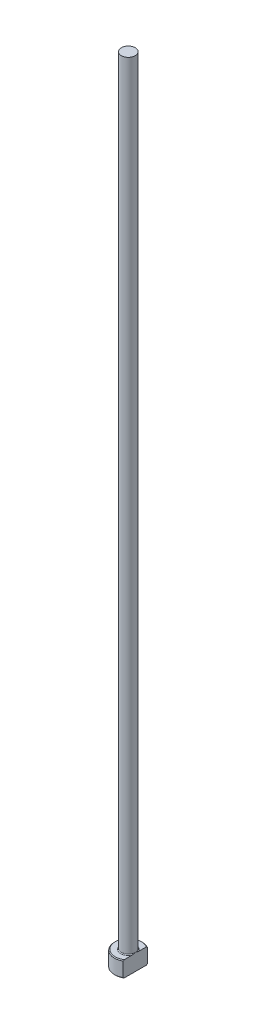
ISO-10303-21;
HEADER;
FILE_DESCRIPTION(('STEP AP214'),'2;1');
FILE_NAME('part.step','',(''),(''),'','','');
FILE_SCHEMA(('AUTOMOTIVE_DESIGN { 1 0 10303 214 1 1 1 1 }'));
ENDSEC;
DATA;
#1=APPLICATION_CONTEXT('core data for automotive mechanical design processes');
#2=APPLICATION_PROTOCOL_DEFINITION('international standard','automotive_design',2000,#1);
#3=PRODUCT_CONTEXT('',#1,'mechanical');
#4=PRODUCT('Part','Part','',(#3));
#5=PRODUCT_RELATED_PRODUCT_CATEGORY('part','',(#4));
#6=PRODUCT_DEFINITION_FORMATION('','',#4);
#7=PRODUCT_DEFINITION_CONTEXT('part definition',#1,'design');
#8=PRODUCT_DEFINITION('design','',#6,#7);
#9=PRODUCT_DEFINITION_SHAPE('','',#8);
#10=(LENGTH_UNIT() NAMED_UNIT(*) SI_UNIT(.MILLI.,.METRE.));
#11=(NAMED_UNIT(*) PLANE_ANGLE_UNIT() SI_UNIT($,.RADIAN.));
#12=(NAMED_UNIT(*) SI_UNIT($,.STERADIAN.) SOLID_ANGLE_UNIT());
#13=UNCERTAINTY_MEASURE_WITH_UNIT(LENGTH_MEASURE(1.E-05),#10,'distance_accuracy_value','');
#14=(GEOMETRIC_REPRESENTATION_CONTEXT(3) GLOBAL_UNCERTAINTY_ASSIGNED_CONTEXT((#13)) GLOBAL_UNIT_ASSIGNED_CONTEXT((#10,
#11,#12)) REPRESENTATION_CONTEXT('',''));
#15=CARTESIAN_POINT('',(0.,0.,0.));
#16=DIRECTION('',(0.,0.,1.));
#17=DIRECTION('',(1.,0.,0.));
#18=AXIS2_PLACEMENT_3D('',#15,#16,#17);
#19=CARTESIAN_POINT('',(0.,0.,0.));
#20=DIRECTION('',(0.,-1.,0.));
#21=DIRECTION('',(0.,0.,-1.));
#22=AXIS2_PLACEMENT_3D('',#19,#20,#21);
#23=PLANE('',#22);
#24=CARTESIAN_POINT('',(0.,0.,0.));
#25=DIRECTION('',(0.,-1.,0.));
#26=DIRECTION('',(0.,0.,-1.));
#27=AXIS2_PLACEMENT_3D('',#24,#25,#26);
#28=CIRCLE('',#27,3.29999999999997);
#29=CARTESIAN_POINT('',(1.74999999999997,0.,2.79776696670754));
#30=VERTEX_POINT('',#29);
#31=CARTESIAN_POINT('',(1.74999999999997,0.,-2.79776696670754));
#32=VERTEX_POINT('',#31);
#33=EDGE_CURVE('E98',#30,#32,#28,.T.);
#34=ORIENTED_EDGE('',*,*,#33,.T.);
#35=DIRECTION('',(0.,0.,1.));
#36=VECTOR('',#35,1.);
#37=CARTESIAN_POINT('',(1.74999999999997,0.,3.03108891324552));
#38=LINE('',#37,#36);
#39=EDGE_CURVE('E83',#32,#30,#38,.T.);
#40=ORIENTED_EDGE('',*,*,#39,.T.);
#41=EDGE_LOOP('',(#34,#40));
#42=FACE_BOUND('',#41,.T.);
#43=ADVANCED_FACE('F32',(#42),#23,.T.);
#44=CARTESIAN_POINT('',(0.,259.958771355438,0.));
#45=DIRECTION('',(0.,1.,0.));
#46=DIRECTION('',(0.,0.,1.));
#47=AXIS2_PLACEMENT_3D('',#44,#45,#46);
#48=CYLINDRICAL_SURFACE('',#47,3.49999999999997);
#49=CARTESIAN_POINT('',(0.,3.80000000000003,0.));
#50=DIRECTION('',(0.,1.,0.));
#51=DIRECTION('',(0.,0.,1.));
#52=AXIS2_PLACEMENT_3D('',#49,#50,#51);
#53=CIRCLE('',#52,3.49999999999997);
#54=CARTESIAN_POINT('',(1.74999999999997,3.80000000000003,3.03108891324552));
#55=VERTEX_POINT('',#54);
#56=CARTESIAN_POINT('',(1.74999999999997,3.80000000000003,-3.03108891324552));
#57=VERTEX_POINT('',#56);
#58=EDGE_CURVE('E104',#55,#57,#53,.F.);
#59=ORIENTED_EDGE('',*,*,#58,.T.);
#60=DIRECTION('',(0.,-1.,0.));
#61=VECTOR('',#60,1.);
#62=CARTESIAN_POINT('',(1.74999999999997,200.,-3.03108891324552));
#63=LINE('',#62,#61);
#64=CARTESIAN_POINT('',(1.74999999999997,0.199999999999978,-3.03108891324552));
#65=VERTEX_POINT('',#64);
#66=EDGE_CURVE('E183',#57,#65,#63,.T.);
#67=ORIENTED_EDGE('',*,*,#66,.T.);
#68=CARTESIAN_POINT('',(0.,0.199999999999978,0.));
#69=DIRECTION('',(0.,-1.,0.));
#70=DIRECTION('',(0.,0.,-1.));
#71=AXIS2_PLACEMENT_3D('',#68,#69,#70);
#72=CIRCLE('',#71,3.49999999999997);
#73=CARTESIAN_POINT('',(1.74999999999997,0.199999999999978,3.03108891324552));
#74=VERTEX_POINT('',#73);
#75=EDGE_CURVE('E100',#65,#74,#72,.F.);
#76=ORIENTED_EDGE('',*,*,#75,.T.);
#77=DIRECTION('',(0.,-1.,0.));
#78=VECTOR('',#77,1.);
#79=CARTESIAN_POINT('',(1.74999999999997,200.,3.03108891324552));
#80=LINE('',#79,#78);
#81=EDGE_CURVE('E93',#55,#74,#80,.T.);
#82=ORIENTED_EDGE('',*,*,#81,.F.);
#83=EDGE_LOOP('',(#59,#67,#76,#82));
#84=FACE_BOUND('',#83,.T.);
#85=ADVANCED_FACE('F158',(#84),#48,.T.);
#86=CARTESIAN_POINT('',(-3.49999999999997,4.,0.));
#87=DIRECTION('',(0.,1.,0.));
#88=DIRECTION('',(0.,0.,1.));
#89=AXIS2_PLACEMENT_3D('',#86,#87,#88);
#90=PLANE('',#89);
#91=CARTESIAN_POINT('',(0.,4.,0.));
#92=DIRECTION('',(0.,1.,0.));
#93=DIRECTION('',(0.,0.,1.));
#94=AXIS2_PLACEMENT_3D('',#91,#92,#93);
#95=CIRCLE('',#94,3.29999999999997);
#96=CARTESIAN_POINT('',(1.74999999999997,4.,-2.79776696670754));
#97=VERTEX_POINT('',#96);
#98=CARTESIAN_POINT('',(1.74999999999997,4.,2.79776696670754));
#99=VERTEX_POINT('',#98);
#100=EDGE_CURVE('E178',#97,#99,#95,.T.);
#101=ORIENTED_EDGE('',*,*,#100,.T.);
#102=DIRECTION('',(0.,0.,-1.));
#103=VECTOR('',#102,1.);
#104=CARTESIAN_POINT('',(1.74999999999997,4.,0.));
#105=LINE('',#104,#103);
#106=CARTESIAN_POINT('',(1.74999999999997,3.99999999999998,0.860232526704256));
#107=VERTEX_POINT('',#106);
#108=EDGE_CURVE('E57',#99,#107,#105,.T.);
#109=ORIENTED_EDGE('',*,*,#108,.T.);
#110=CARTESIAN_POINT('',(0.,4.,0.));
#111=DIRECTION('',(0.,1.,0.));
#112=DIRECTION('',(0.,0.,1.));
#113=AXIS2_PLACEMENT_3D('',#110,#111,#112);
#114=CIRCLE('',#113,1.94999999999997);
#115=CARTESIAN_POINT('',(1.74999999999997,3.99999999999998,-0.860232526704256));
#116=VERTEX_POINT('',#115);
#117=EDGE_CURVE('E107',#107,#116,#114,.F.);
#118=ORIENTED_EDGE('',*,*,#117,.T.);
#119=EDGE_CURVE('E136',#116,#97,#105,.T.);
#120=ORIENTED_EDGE('',*,*,#119,.T.);
#121=EDGE_LOOP('',(#101,#109,#118,#120));
#122=FACE_BOUND('',#121,.T.);
#123=ADVANCED_FACE('F147',(#122),#90,.T.);
#124=CARTESIAN_POINT('',(0.,4.,0.));
#125=DIRECTION('',(0.,-1.,0.));
#126=DIRECTION('',(0.,0.,-1.));
#127=AXIS2_PLACEMENT_3D('',#124,#125,#126);
#128=CONICAL_SURFACE('',#127,3.29999999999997,0.785398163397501);
#129=ORIENTED_EDGE('',*,*,#58,.F.);
#130=CARTESIAN_POINT('',(1.74999999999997,0.403691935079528,6.67057455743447));
#131=CARTESIAN_POINT('',(1.74999999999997,0.549902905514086,6.51940719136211));
#132=CARTESIAN_POINT('',(1.74999999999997,0.695956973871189,6.3680875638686));
#133=CARTESIAN_POINT('',(1.74999999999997,0.987658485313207,6.06505321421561));
#134=CARTESIAN_POINT('',(1.74999999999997,1.13330592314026,5.91333848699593));
#135=CARTESIAN_POINT('',(1.74999999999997,1.42417201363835,5.60934946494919));
#136=CARTESIAN_POINT('',(1.74999999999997,1.56939040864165,5.45707492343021));
#137=CARTESIAN_POINT('',(1.74999999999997,1.85918520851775,5.15191761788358));
#138=CARTESIAN_POINT('',(1.74999999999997,2.0037616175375,4.9990348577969));
#139=CARTESIAN_POINT('',(1.74999999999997,2.28922437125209,4.69552747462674));
#140=CARTESIAN_POINT('',(1.74999999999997,2.43012702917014,4.54491820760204));
#141=CARTESIAN_POINT('',(1.74999999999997,2.71087777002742,4.24272028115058));
#142=CARTESIAN_POINT('',(1.74999999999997,2.85072585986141,4.0911316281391));
#143=CARTESIAN_POINT('',(1.74999999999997,3.12895853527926,3.78667524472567));
#144=CARTESIAN_POINT('',(1.74999999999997,3.26734342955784,3.63380779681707));
#145=CARTESIAN_POINT('',(1.74999999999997,3.54209958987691,3.32627683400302));
#146=CARTESIAN_POINT('',(1.74999999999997,3.67847093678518,3.17161339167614));
#147=CARTESIAN_POINT('',(1.74999999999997,3.8961728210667,2.91990258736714));
#148=CARTESIAN_POINT('',(1.74999999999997,3.97843114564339,2.82365864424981));
#149=CARTESIAN_POINT('',(1.74999999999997,4.14148360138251,2.62991861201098));
#150=CARTESIAN_POINT('',(1.74999999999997,4.2222775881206,2.53242240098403));
#151=CARTESIAN_POINT('',(1.74999999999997,4.38274452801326,2.33479038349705));
#152=CARTESIAN_POINT('',(1.74999999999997,4.46239661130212,2.23463757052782));
#153=CARTESIAN_POINT('',(1.74999999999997,4.61891495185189,2.03220225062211));
#154=CARTESIAN_POINT('',(1.74999999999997,4.69578187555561,1.92992026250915));
#155=CARTESIAN_POINT('',(1.74999999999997,4.84669654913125,1.72090511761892));
#156=CARTESIAN_POINT('',(1.74999999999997,4.92068375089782,1.61412795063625));
#157=CARTESIAN_POINT('',(1.74999999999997,5.06269616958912,1.39638381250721));
#158=CARTESIAN_POINT('',(1.74999999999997,5.13071318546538,1.28541136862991));
#159=CARTESIAN_POINT('',(1.74999999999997,5.22516490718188,1.11561175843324));
#160=CARTESIAN_POINT('',(1.74999999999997,5.25522351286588,1.058816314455));
#161=CARTESIAN_POINT('',(1.74999999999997,5.31237042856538,0.943756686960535));
#162=CARTESIAN_POINT('',(1.74999999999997,5.33945819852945,0.885492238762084));
#163=CARTESIAN_POINT('',(1.74999999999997,5.41499290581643,0.708569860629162));
#164=CARTESIAN_POINT('',(1.74999999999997,5.45796078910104,0.58735672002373));
#165=CARTESIAN_POINT('',(1.74999999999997,5.50447230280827,0.405622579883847));
#166=CARTESIAN_POINT('',(1.74999999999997,5.51680920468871,0.347327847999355));
#167=CARTESIAN_POINT('',(1.74999999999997,5.53592536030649,0.229813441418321));
#168=CARTESIAN_POINT('',(1.74999999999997,5.54270510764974,0.170593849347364));
#169=CARTESIAN_POINT('',(1.74999999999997,5.55022681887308,0.0519516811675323));
#170=CARTESIAN_POINT('',(1.74999999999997,5.55098747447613,-0.00746969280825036));
#171=CARTESIAN_POINT('',(1.74999999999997,5.5464654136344,-0.12608281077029));
#172=CARTESIAN_POINT('',(1.74999999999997,5.54118219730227,-0.185274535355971));
#173=CARTESIAN_POINT('',(1.74999999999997,5.52501178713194,-0.302357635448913));
#174=CARTESIAN_POINT('',(1.74999999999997,5.51417270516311,-0.360255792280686));
#175=CARTESIAN_POINT('',(1.74999999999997,5.48756668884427,-0.474896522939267));
#176=CARTESIAN_POINT('',(1.74999999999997,5.47179916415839,-0.531638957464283));
#177=CARTESIAN_POINT('',(1.74999999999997,5.43599695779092,-0.64410319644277));
#178=CARTESIAN_POINT('',(1.74999999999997,5.41593824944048,-0.699817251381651));
#179=CARTESIAN_POINT('',(1.74999999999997,5.37235913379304,-0.809843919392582));
#180=CARTESIAN_POINT('',(1.74999999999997,5.348839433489,-0.864156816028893));
#181=CARTESIAN_POINT('',(1.74999999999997,5.27385837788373,-1.0256237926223));
#182=CARTESIAN_POINT('',(1.74999999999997,5.21814894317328,-1.13079943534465));
#183=CARTESIAN_POINT('',(1.74999999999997,5.09935726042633,-1.33694307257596));
#184=CARTESIAN_POINT('',(1.74999999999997,5.03626572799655,-1.43790554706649));
#185=CARTESIAN_POINT('',(1.74999999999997,4.90490246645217,-1.63694628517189));
#186=CARTESIAN_POINT('',(1.74999999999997,4.83661129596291,-1.73501160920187));
#187=CARTESIAN_POINT('',(1.74999999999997,4.69663576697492,-1.92859117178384));
#188=CARTESIAN_POINT('',(1.74999999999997,4.62495312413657,-2.02410666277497));
#189=CARTESIAN_POINT('',(1.74999999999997,4.47817312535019,-2.21448054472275));
#190=CARTESIAN_POINT('',(1.74999999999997,4.4030432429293,-2.30931373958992));
#191=CARTESIAN_POINT('',(1.74999999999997,4.25092223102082,-2.49748629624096));
#192=CARTESIAN_POINT('',(1.74999999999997,4.17393090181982,-2.59082549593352));
#193=CARTESIAN_POINT('',(1.74999999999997,4.01873588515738,-2.77610276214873));
#194=CARTESIAN_POINT('',(1.74999999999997,3.94053559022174,-2.86804367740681));
#195=CARTESIAN_POINT('',(1.74999999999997,3.78305359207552,-3.05099558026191));
#196=CARTESIAN_POINT('',(1.74999999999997,3.70377186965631,-3.14200655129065));
#197=CARTESIAN_POINT('',(1.74999999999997,3.4917775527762,-3.38307713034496));
#198=CARTESIAN_POINT('',(1.74999999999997,3.3583209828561,-3.53248201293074));
#199=CARTESIAN_POINT('',(1.74999999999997,3.08977689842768,-3.82982116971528));
#200=CARTESIAN_POINT('',(1.74999999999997,2.95468933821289,-3.97775540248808));
#201=CARTESIAN_POINT('',(1.74999999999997,2.68319766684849,-4.27266697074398));
#202=CARTESIAN_POINT('',(1.74999999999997,2.5467924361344,-4.41964327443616));
#203=CARTESIAN_POINT('',(1.74999999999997,2.27308598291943,-4.71275937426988));
#204=CARTESIAN_POINT('',(1.74999999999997,2.13578475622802,-4.85889916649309));
#205=CARTESIAN_POINT('',(1.74999999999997,1.73418398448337,-5.28435414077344));
#206=CARTESIAN_POINT('',(1.74999999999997,1.46897142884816,-5.56280727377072));
#207=CARTESIAN_POINT('',(1.74999999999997,1.07010496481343,-5.97918348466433));
#208=CARTESIAN_POINT('',(1.74999999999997,0.937049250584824,-6.11768155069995));
#209=CARTESIAN_POINT('',(1.74999999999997,0.670604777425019,-6.39435480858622));
#210=CARTESIAN_POINT('',(1.74999999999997,0.537216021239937,-6.53253000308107));
#211=CARTESIAN_POINT('',(1.74999999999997,0.403691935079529,-6.67057455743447));
#212=B_SPLINE_CURVE_WITH_KNOTS('',3,(#130,#131,#132,#133,#134,#135,#136,#137,#138,#139,#140,
#141,#142,#143,#144,#145,#146,#147,#148,#149,#150,#151,#152,#153,#154,#155,#156,#157,#158,#159,
#160,#161,#162,#163,#164,#165,#166,#167,#168,#169,#170,#171,#172,#173,#174,#175,#176,#177,#178,
#179,#180,#181,#182,#183,#184,#185,#186,#187,#188,#189,#190,#191,#192,#193,#194,#195,#196,#197,
#198,#199,#200,#201,#202,#203,#204,#205,#206,#207,#208,#209,#210,#211),.UNSPECIFIED.,.F.,.F.,(4,
2,2,2,2,2,2,2,2,2,2,2,2,2,2,2,2,2,2,2,2,2,2,2,2,2,2,2,2,2,2,2,2,2,2,2,2,2,2,2,4),(0.,
0.630922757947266,1.26185363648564,1.89310749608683,2.52435727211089,3.14308654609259,
3.76181177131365,4.38040374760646,4.9989708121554,5.37878108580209,5.7586286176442,
6.14249031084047,6.52625953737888,6.91585739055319,7.30598230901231,7.49867618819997,
7.69140503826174,8.07538783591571,8.25392686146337,8.43245002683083,8.61041858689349,
8.78840186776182,8.96486927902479,9.14135783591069,9.31886171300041,9.49632938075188,
9.85286274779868,10.2098494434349,10.5682434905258,10.9264581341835,11.2893876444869,
11.6523562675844,12.0144447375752,12.3765396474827,12.9775131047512,13.5785034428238,
14.1800594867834,14.7816183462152,15.9352370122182,16.51140505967,17.0875683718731),.UNSPECIFIED.);
#213=EDGE_CURVE('E135',#55,#99,#212,.T.);
#214=ORIENTED_EDGE('',*,*,#213,.T.);
#215=ORIENTED_EDGE('',*,*,#100,.F.);
#216=EDGE_CURVE('E127',#97,#57,#212,.T.);
#217=ORIENTED_EDGE('',*,*,#216,.T.);
#218=EDGE_LOOP('',(#129,#214,#215,#217));
#219=FACE_BOUND('',#218,.T.);
#220=ADVANCED_FACE('F143',(#219),#128,.T.);
#221=CARTESIAN_POINT('',(0.,0.199999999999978,0.));
#222=DIRECTION('',(0.,1.,0.));
#223=DIRECTION('',(0.,0.,1.));
#224=AXIS2_PLACEMENT_3D('',#221,#222,#223);
#225=CONICAL_SURFACE('',#224,3.49999999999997,0.785398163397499);
#226=ORIENTED_EDGE('',*,*,#75,.F.);
#227=CARTESIAN_POINT('',(1.74999999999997,3.59630806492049,-6.67057455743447));
#228=CARTESIAN_POINT('',(1.74999999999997,3.45009709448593,-6.51940719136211));
#229=CARTESIAN_POINT('',(1.74999999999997,3.30404302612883,-6.36808756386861));
#230=CARTESIAN_POINT('',(1.74999999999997,3.01234151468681,-6.0650532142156));
#231=CARTESIAN_POINT('',(1.74999999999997,2.86669407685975,-5.91333848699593));
#232=CARTESIAN_POINT('',(1.74999999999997,2.57582798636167,-5.60934946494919));
#233=CARTESIAN_POINT('',(1.74999999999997,2.43060959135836,-5.45707492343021));
#234=CARTESIAN_POINT('',(1.74999999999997,2.14081479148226,-5.15191761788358));
#235=CARTESIAN_POINT('',(1.74999999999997,1.99623838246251,-4.9990348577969));
#236=CARTESIAN_POINT('',(1.74999999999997,1.71077562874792,-4.69552747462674));
#237=CARTESIAN_POINT('',(1.74999999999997,1.56987297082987,-4.54491820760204));
#238=CARTESIAN_POINT('',(1.74999999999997,1.28912222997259,-4.24272028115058));
#239=CARTESIAN_POINT('',(1.74999999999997,1.1492741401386,-4.0911316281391));
#240=CARTESIAN_POINT('',(1.74999999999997,0.871041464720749,-3.78667524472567));
#241=CARTESIAN_POINT('',(1.74999999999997,0.732656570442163,-3.63380779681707));
#242=CARTESIAN_POINT('',(1.74999999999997,0.457900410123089,-3.32627683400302));
#243=CARTESIAN_POINT('',(1.74999999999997,0.321529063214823,-3.17161339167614));
#244=CARTESIAN_POINT('',(1.74999999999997,0.103827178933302,-2.91990258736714));
#245=CARTESIAN_POINT('',(1.74999999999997,0.021568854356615,-2.82365864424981));
#246=CARTESIAN_POINT('',(1.74999999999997,-0.141483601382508,-2.62991861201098));
#247=CARTESIAN_POINT('',(1.74999999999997,-0.222277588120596,-2.53242240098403));
#248=CARTESIAN_POINT('',(1.74999999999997,-0.382744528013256,-2.33479038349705));
#249=CARTESIAN_POINT('',(1.74999999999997,-0.462396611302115,-2.23463757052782));
#250=CARTESIAN_POINT('',(1.74999999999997,-0.618914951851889,-2.03220225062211));
#251=CARTESIAN_POINT('',(1.74999999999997,-0.695781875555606,-1.92992026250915));
#252=CARTESIAN_POINT('',(1.74999999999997,-0.84669654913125,-1.72090511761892));
#253=CARTESIAN_POINT('',(1.74999999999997,-0.920683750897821,-1.61412795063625));
#254=CARTESIAN_POINT('',(1.74999999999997,-1.06269616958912,-1.39638381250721));
#255=CARTESIAN_POINT('',(1.74999999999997,-1.13071318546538,-1.28541136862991));
#256=CARTESIAN_POINT('',(1.74999999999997,-1.22516490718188,-1.11561175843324));
#257=CARTESIAN_POINT('',(1.74999999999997,-1.25522351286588,-1.058816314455));
#258=CARTESIAN_POINT('',(1.74999999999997,-1.31237042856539,-0.943756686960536));
#259=CARTESIAN_POINT('',(1.74999999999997,-1.33945819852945,-0.885492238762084));
#260=CARTESIAN_POINT('',(1.74999999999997,-1.41499290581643,-0.708569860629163));
#261=CARTESIAN_POINT('',(1.74999999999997,-1.45796078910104,-0.587356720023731));
#262=CARTESIAN_POINT('',(1.74999999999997,-1.50447230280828,-0.405622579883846));
#263=CARTESIAN_POINT('',(1.74999999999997,-1.51680920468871,-0.347327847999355));
#264=CARTESIAN_POINT('',(1.74999999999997,-1.53592536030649,-0.229813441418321));
#265=CARTESIAN_POINT('',(1.74999999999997,-1.54270510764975,-0.170593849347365));
#266=CARTESIAN_POINT('',(1.74999999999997,-1.55022681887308,-0.0519516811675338));
#267=CARTESIAN_POINT('',(1.74999999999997,-1.55098747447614,0.0074696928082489));
#268=CARTESIAN_POINT('',(1.74999999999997,-1.54646541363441,0.126082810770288));
#269=CARTESIAN_POINT('',(1.74999999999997,-1.54118219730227,0.185274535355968));
#270=CARTESIAN_POINT('',(1.74999999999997,-1.52501178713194,0.30235763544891));
#271=CARTESIAN_POINT('',(1.74999999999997,-1.51417270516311,0.360255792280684));
#272=CARTESIAN_POINT('',(1.74999999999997,-1.48756668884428,0.474896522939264));
#273=CARTESIAN_POINT('',(1.74999999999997,-1.4717991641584,0.531638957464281));
#274=CARTESIAN_POINT('',(1.74999999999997,-1.43599695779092,0.644103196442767));
#275=CARTESIAN_POINT('',(1.74999999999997,-1.41593824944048,0.699817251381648));
#276=CARTESIAN_POINT('',(1.74999999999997,-1.37235913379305,0.809843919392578));
#277=CARTESIAN_POINT('',(1.74999999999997,-1.348839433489,0.864156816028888));
#278=CARTESIAN_POINT('',(1.74999999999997,-1.27385837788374,1.02562379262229));
#279=CARTESIAN_POINT('',(1.74999999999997,-1.21814894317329,1.13079943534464));
#280=CARTESIAN_POINT('',(1.74999999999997,-1.09935726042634,1.33694307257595));
#281=CARTESIAN_POINT('',(1.74999999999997,-1.03626572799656,1.43790554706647));
#282=CARTESIAN_POINT('',(1.74999999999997,-0.904902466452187,1.63694628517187));
#283=CARTESIAN_POINT('',(1.74999999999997,-0.836611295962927,1.73501160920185));
#284=CARTESIAN_POINT('',(1.74999999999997,-0.696635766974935,1.92859117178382));
#285=CARTESIAN_POINT('',(1.74999999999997,-0.62495312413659,2.02410666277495));
#286=CARTESIAN_POINT('',(1.74999999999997,-0.478173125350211,2.21448054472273));
#287=CARTESIAN_POINT('',(1.74999999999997,-0.403043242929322,2.30931373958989));
#288=CARTESIAN_POINT('',(1.74999999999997,-0.250922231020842,2.49748629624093));
#289=CARTESIAN_POINT('',(1.74999999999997,-0.173930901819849,2.59082549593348));
#290=CARTESIAN_POINT('',(1.74999999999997,-0.0187358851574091,2.77610276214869));
#291=CARTESIAN_POINT('',(1.74999999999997,0.0594644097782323,2.86804367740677));
#292=CARTESIAN_POINT('',(1.74999999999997,0.216946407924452,3.05099558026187));
#293=CARTESIAN_POINT('',(1.74999999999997,0.296228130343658,3.14200655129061));
#294=CARTESIAN_POINT('',(1.74999999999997,0.508222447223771,3.38307713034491));
#295=CARTESIAN_POINT('',(1.74999999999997,0.641679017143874,3.5324820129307));
#296=CARTESIAN_POINT('',(1.74999999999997,0.910223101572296,3.82982116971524));
#297=CARTESIAN_POINT('',(1.74999999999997,1.04531066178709,3.97775540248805));
#298=CARTESIAN_POINT('',(1.74999999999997,1.31680233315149,4.27266697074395));
#299=CARTESIAN_POINT('',(1.74999999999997,1.45320756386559,4.41964327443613));
#300=CARTESIAN_POINT('',(1.74999999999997,1.72691401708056,4.71275937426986));
#301=CARTESIAN_POINT('',(1.74999999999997,1.86421524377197,4.85889916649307));
#302=CARTESIAN_POINT('',(1.74999999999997,2.26581601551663,5.28435414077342));
#303=CARTESIAN_POINT('',(1.74999999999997,2.53102857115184,5.56280727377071));
#304=CARTESIAN_POINT('',(1.74999999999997,2.92989503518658,5.97918348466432));
#305=CARTESIAN_POINT('',(1.74999999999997,3.06295074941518,6.11768155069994));
#306=CARTESIAN_POINT('',(1.74999999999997,3.329395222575,6.39435480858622));
#307=CARTESIAN_POINT('',(1.74999999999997,3.46278397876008,6.53253000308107));
#308=CARTESIAN_POINT('',(1.74999999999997,3.59630806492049,6.67057455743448));
#309=B_SPLINE_CURVE_WITH_KNOTS('',3,(#227,#228,#229,#230,#231,#232,#233,#234,#235,#236,#237,
#238,#239,#240,#241,#242,#243,#244,#245,#246,#247,#248,#249,#250,#251,#252,#253,#254,#255,#256,
#257,#258,#259,#260,#261,#262,#263,#264,#265,#266,#267,#268,#269,#270,#271,#272,#273,#274,#275,
#276,#277,#278,#279,#280,#281,#282,#283,#284,#285,#286,#287,#288,#289,#290,#291,#292,#293,#294,
#295,#296,#297,#298,#299,#300,#301,#302,#303,#304,#305,#306,#307,#308),.UNSPECIFIED.,.F.,.F.,(4,
2,2,2,2,2,2,2,2,2,2,2,2,2,2,2,2,2,2,2,2,2,2,2,2,2,2,2,2,2,2,2,2,2,2,2,2,2,2,2,4),(0.,
0.630922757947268,1.26185363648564,1.89310749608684,2.52435727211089,3.1430865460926,
3.76181177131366,4.38040374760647,4.99897081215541,5.37878108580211,5.75862861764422,
6.14249031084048,6.52625953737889,6.9158573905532,7.30598230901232,7.49867618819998,
7.69140503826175,8.07538783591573,8.25392686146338,8.43245002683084,8.6104185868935,
8.78840186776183,8.9648692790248,9.14135783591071,9.31886171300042,9.49632938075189,
9.85286274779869,10.2098494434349,10.5682434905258,10.9264581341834,11.2893876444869,
11.6523562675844,12.0144447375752,12.3765396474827,12.9775131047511,13.5785034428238,
14.1800594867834,14.7816183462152,15.9352370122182,16.51140505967,17.0875683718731),.UNSPECIFIED.);
#310=EDGE_CURVE('E86',#65,#32,#309,.T.);
#311=ORIENTED_EDGE('',*,*,#310,.T.);
#312=ORIENTED_EDGE('',*,*,#33,.F.);
#313=EDGE_CURVE('E89',#30,#74,#309,.T.);
#314=ORIENTED_EDGE('',*,*,#313,.T.);
#315=EDGE_LOOP('',(#226,#311,#312,#314));
#316=FACE_BOUND('',#315,.T.);
#317=ADVANCED_FACE('F97',(#316),#225,.T.);
#318=CARTESIAN_POINT('',(0.,4.19999999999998,0.));
#319=DIRECTION('',(0.,1.,0.));
#320=DIRECTION('',(0.,0.,1.));
#321=AXIS2_PLACEMENT_3D('',#318,#319,#320);
#322=TOROIDAL_SURFACE('',#321,1.94999999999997,0.2);
#323=CARTESIAN_POINT('',(1.74999999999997,4.19999999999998,0.));
#324=CARTESIAN_POINT('',(1.74999999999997,4.2000005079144,9.3867964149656E-11));
#325=CARTESIAN_POINT('',(1.74999999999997,4.20000101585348,-1.34501103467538E-07));
#326=CARTESIAN_POINT('',(1.74999999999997,4.20000198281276,-5.41283480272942E-07));
#327=CARTESIAN_POINT('',(1.74999999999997,4.20000243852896,-8.19487716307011E-07));
#328=CARTESIAN_POINT('',(1.74999999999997,4.2000033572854,-1.4843911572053E-06));
#329=CARTESIAN_POINT('',(1.74999999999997,4.20000381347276,-1.8805263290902E-06));
#330=CARTESIAN_POINT('',(1.74999999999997,4.2000046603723,-2.72280867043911E-06));
#331=CARTESIAN_POINT('',(1.74999999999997,4.20000505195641,-3.16812554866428E-06));
#332=CARTESIAN_POINT('',(1.74999999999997,4.20000641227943,-4.80772283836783E-06));
#333=CARTESIAN_POINT('',(1.74999999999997,4.20000730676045,-6.06508173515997E-06));
#334=CARTESIAN_POINT('',(1.74999999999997,4.20000885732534,-8.62364313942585E-06));
#335=CARTESIAN_POINT('',(1.74999999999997,4.2000095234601,-9.91907771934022E-06));
#336=CARTESIAN_POINT('',(1.74999999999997,4.20001212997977,-1.51310766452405E-05));
#337=CARTESIAN_POINT('',(1.74999999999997,4.20001395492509,-1.91092656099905E-05));
#338=CARTESIAN_POINT('',(1.74999999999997,4.200016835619,-2.68327807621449E-05));
#339=CARTESIAN_POINT('',(1.74999999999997,4.20001795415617,-3.05551301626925E-05));
#340=CARTESIAN_POINT('',(1.74999999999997,4.20002287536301,-4.68261375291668E-05));
#341=CARTESIAN_POINT('',(1.74999999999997,4.20002674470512,-5.93446279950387E-05));
#342=CARTESIAN_POINT('',(1.74999999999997,4.20003278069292,-8.25255943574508E-05));
#343=CARTESIAN_POINT('',(1.74999999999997,4.2000351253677,-9.31393224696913E-05));
#344=CARTESIAN_POINT('',(1.74999999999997,4.20005413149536,-0.000171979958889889));
#345=CARTESIAN_POINT('',(1.74999999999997,4.20007897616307,-0.000237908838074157));
#346=CARTESIAN_POINT('',(1.74999999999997,4.20017305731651,-0.000496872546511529));
#347=CARTESIAN_POINT('',(1.74999999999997,4.20023617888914,-0.000691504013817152));
#348=CARTESIAN_POINT('',(1.74999999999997,4.20048774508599,-0.00145613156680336));
#349=CARTESIAN_POINT('',(1.74999999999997,4.20068259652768,-0.00202450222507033));
#350=CARTESIAN_POINT('',(1.74999999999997,4.20148279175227,-0.00436941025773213));
#351=CARTESIAN_POINT('',(1.74999999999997,4.20208089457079,-0.00614773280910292));
#352=CARTESIAN_POINT('',(1.74999999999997,4.20853845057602,-0.0253339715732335));
#353=CARTESIAN_POINT('',(1.74999999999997,4.21443574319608,-0.0427328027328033));
#354=CARTESIAN_POINT('',(1.74999999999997,4.22594434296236,-0.076884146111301));
#355=CARTESIAN_POINT('',(1.74999999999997,4.23155796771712,-0.0936359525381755));
#356=CARTESIAN_POINT('',(1.74999999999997,4.24339960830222,-0.129193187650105));
#357=CARTESIAN_POINT('',(1.74999999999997,4.24961959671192,-0.148001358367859));
#358=CARTESIAN_POINT('',(1.74999999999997,4.26199268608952,-0.185858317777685));
#359=CARTESIAN_POINT('',(1.74999999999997,4.26814439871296,-0.204907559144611));
#360=CARTESIAN_POINT('',(1.74999999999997,4.28302129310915,-0.251728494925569));
#361=CARTESIAN_POINT('',(1.74999999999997,4.2916463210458,-0.279532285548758));
#362=CARTESIAN_POINT('',(1.74999999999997,4.30815507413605,-0.334622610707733));
#363=CARTESIAN_POINT('',(1.74999999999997,4.3160517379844,-0.36190524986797));
#364=CARTESIAN_POINT('',(1.74999999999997,4.33270110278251,-0.422187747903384));
#365=CARTESIAN_POINT('',(1.74999999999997,4.34130455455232,-0.455229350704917));
#366=CARTESIAN_POINT('',(1.74999999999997,4.35728256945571,-0.521873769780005));
#367=CARTESIAN_POINT('',(1.74999999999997,4.36464748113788,-0.555478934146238));
#368=CARTESIAN_POINT('',(1.74999999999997,4.37810121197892,-0.625225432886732));
#369=CARTESIAN_POINT('',(1.74999999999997,4.38407559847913,-0.661389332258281));
#370=CARTESIAN_POINT('',(1.74999999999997,4.39348021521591,-0.733973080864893));
#371=CARTESIAN_POINT('',(1.74999999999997,4.39691695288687,-0.77039203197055));
#372=CARTESIAN_POINT('',(1.74999999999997,4.39990626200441,-0.832262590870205));
#373=CARTESIAN_POINT('',(1.74999999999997,4.40032395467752,-0.857670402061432));
#374=CARTESIAN_POINT('',(1.74999999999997,4.39916217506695,-0.908260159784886));
#375=CARTESIAN_POINT('',(1.74999999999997,4.39759783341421,-0.933442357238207));
#376=CARTESIAN_POINT('',(1.74999999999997,4.39129859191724,-0.989903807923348));
#377=CARTESIAN_POINT('',(1.74999999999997,4.38586007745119,-1.02110925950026));
#378=CARTESIAN_POINT('',(1.74999999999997,4.36964168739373,-1.08216800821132));
#379=CARTESIAN_POINT('',(1.74999999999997,4.35888918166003,-1.11202738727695));
#380=CARTESIAN_POINT('',(1.74999999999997,4.33961802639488,-1.14878048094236));
#381=CARTESIAN_POINT('',(1.74999999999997,4.33455492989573,-1.15748014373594));
#382=CARTESIAN_POINT('',(1.74999999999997,4.32351587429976,-1.17429661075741));
#383=CARTESIAN_POINT('',(1.74999999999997,4.31753946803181,-1.18241312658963));
#384=CARTESIAN_POINT('',(1.74999999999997,4.30451428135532,-1.19787793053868));
#385=CARTESIAN_POINT('',(1.74999999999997,4.29745609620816,-1.20521842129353));
#386=CARTESIAN_POINT('',(1.74999999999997,4.28223524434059,-1.21865698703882));
#387=CARTESIAN_POINT('',(1.74999999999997,4.27407476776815,-1.22475746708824));
#388=CARTESIAN_POINT('',(1.74999999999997,4.25920166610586,-1.23370537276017));
#389=CARTESIAN_POINT('',(1.74999999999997,4.25274944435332,-1.23698363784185));
#390=CARTESIAN_POINT('',(1.74999999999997,4.23939659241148,-1.24245066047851));
#391=CARTESIAN_POINT('',(1.74999999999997,4.23249637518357,-1.2446404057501));
#392=CARTESIAN_POINT('',(1.74999999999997,4.21836445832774,-1.24776583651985));
#393=CARTESIAN_POINT('',(1.74999999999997,4.21113087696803,-1.24869317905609));
#394=CARTESIAN_POINT('',(1.74999999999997,4.19661788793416,-1.24917680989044));
#395=CARTESIAN_POINT('',(1.74999999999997,4.18933848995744,-1.2487333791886));
#396=CARTESIAN_POINT('',(1.74999999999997,4.17564813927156,-1.2466228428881));
#397=CARTESIAN_POINT('',(1.74999999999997,4.16921873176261,-1.24507159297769));
#398=CARTESIAN_POINT('',(1.74999999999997,4.1566813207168,-1.24099086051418));
#399=CARTESIAN_POINT('',(1.74999999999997,4.15057343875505,-1.23846101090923));
#400=CARTESIAN_POINT('',(1.74999999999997,4.13656990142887,-1.23147130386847));
#401=CARTESIAN_POINT('',(1.74999999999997,4.12885825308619,-1.22664351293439));
#402=CARTESIAN_POINT('',(1.74999999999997,4.11430996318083,-1.21581214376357));
#403=CARTESIAN_POINT('',(1.74999999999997,4.10747539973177,-1.20980585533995));
#404=CARTESIAN_POINT('',(1.74999999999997,4.09141283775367,-1.19367262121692));
#405=CARTESIAN_POINT('',(1.74999999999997,4.08273353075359,-1.18300273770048));
#406=CARTESIAN_POINT('',(1.74999999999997,4.06710756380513,-1.16049397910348));
#407=CARTESIAN_POINT('',(1.74999999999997,4.06016260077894,-1.14865397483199));
#408=CARTESIAN_POINT('',(1.74999999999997,4.04314403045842,-1.11526045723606));
#409=CARTESIAN_POINT('',(1.74999999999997,4.03452872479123,-1.09297031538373));
#410=CARTESIAN_POINT('',(1.74999999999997,4.02051872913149,-1.04724849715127));
#411=CARTESIAN_POINT('',(1.74999999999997,4.015155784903,-1.02380790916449));
#412=CARTESIAN_POINT('',(1.74999999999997,4.00698483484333,-0.976403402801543));
#413=CARTESIAN_POINT('',(1.74999999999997,4.00418732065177,-0.952437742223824));
#414=CARTESIAN_POINT('',(1.74999999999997,4.00064912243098,-0.904321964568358));
#415=CARTESIAN_POINT('',(1.74999999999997,3.99991269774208,-0.88017156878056));
#416=CARTESIAN_POINT('',(1.74999999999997,4.00019275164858,-0.809643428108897));
#417=CARTESIAN_POINT('',(1.74999999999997,4.00344813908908,-0.763278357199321));
#418=CARTESIAN_POINT('',(1.74999999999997,4.01492484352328,-0.664825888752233));
#419=CARTESIAN_POINT('',(1.74999999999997,4.02376250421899,-0.612819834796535));
#420=CARTESIAN_POINT('',(1.74999999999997,4.04538488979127,-0.508370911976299));
#421=CARTESIAN_POINT('',(1.74999999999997,4.0582587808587,-0.455947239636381));
#422=CARTESIAN_POINT('',(1.74999999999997,4.08196429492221,-0.368604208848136));
#423=CARTESIAN_POINT('',(1.74999999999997,4.09211504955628,-0.333493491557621));
#424=CARTESIAN_POINT('',(1.74999999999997,4.11312724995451,-0.263893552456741));
#425=CARTESIAN_POINT('',(1.74999999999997,4.12397997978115,-0.229401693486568));
#426=CARTESIAN_POINT('',(1.74999999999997,4.14496676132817,-0.164340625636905));
#427=CARTESIAN_POINT('',(1.74999999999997,4.15504975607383,-0.133754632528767));
#428=CARTESIAN_POINT('',(1.74999999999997,4.17587821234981,-0.0714242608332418));
#429=CARTESIAN_POINT('',(1.74999999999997,4.18663395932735,-0.0396831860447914));
#430=CARTESIAN_POINT('',(1.74999999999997,4.19791979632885,-0.00614534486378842));
#431=CARTESIAN_POINT('',(1.74999999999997,4.19851877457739,-0.00436467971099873));
#432=CARTESIAN_POINT('',(1.74999999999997,4.19931918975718,-0.00201922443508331));
#433=CARTESIAN_POINT('',(1.74999999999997,4.19951342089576,-0.00145265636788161));
#434=CARTESIAN_POINT('',(1.74999999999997,4.19976423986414,-0.000690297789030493));
#435=CARTESIAN_POINT('',(1.74999999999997,4.19982721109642,-0.000496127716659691));
#436=CARTESIAN_POINT('',(1.74999999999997,4.19992109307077,-0.000237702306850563));
#437=CARTESIAN_POINT('',(1.74999999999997,4.19994590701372,-0.000171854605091));
#438=CARTESIAN_POINT('',(1.74999999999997,4.19996489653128,-9.3104554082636E-05));
#439=CARTESIAN_POINT('',(1.74999999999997,4.1999672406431,-8.24963339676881E-05));
#440=CARTESIAN_POINT('',(1.74999999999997,4.19997327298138,-5.9327776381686E-05));
#441=CARTESIAN_POINT('',(1.74999999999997,4.19997713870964,-4.68160430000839E-05));
#442=CARTESIAN_POINT('',(1.74999999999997,4.19998205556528,-3.0552584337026E-05));
#443=CARTESIAN_POINT('',(1.74999999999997,4.19998317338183,-2.68310311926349E-05));
#444=CARTESIAN_POINT('',(1.74999999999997,4.19998605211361,-1.91090651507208E-05));
#445=CARTESIAN_POINT('',(1.74999999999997,4.1999878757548,-1.51315954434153E-05));
#446=CARTESIAN_POINT('',(1.74999999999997,4.19999048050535,-9.92029976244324E-06));
#447=CARTESIAN_POINT('',(1.74999999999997,4.19999114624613,-8.62492595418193E-06));
#448=CARTESIAN_POINT('',(1.74999999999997,4.19999269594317,-6.06641158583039E-06));
#449=CARTESIAN_POINT('',(1.74999999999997,4.19999358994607,-4.80903338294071E-06));
#450=CARTESIAN_POINT('',(1.74999999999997,4.19999494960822,-3.1693219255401E-06));
#451=CARTESIAN_POINT('',(1.74999999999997,4.19999534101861,-2.7239538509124E-06));
#452=CARTESIAN_POINT('',(1.74999999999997,4.19999618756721,-1.88153783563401E-06));
#453=CARTESIAN_POINT('',(1.74999999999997,4.19999664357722,-1.48531960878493E-06));
#454=CARTESIAN_POINT('',(1.74999999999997,4.19999756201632,-8.20216876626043E-07));
#455=CARTESIAN_POINT('',(1.74999999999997,4.19999801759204,-5.41901820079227E-07));
#456=CARTESIAN_POINT('',(1.74999999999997,4.19999898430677,-1.34847130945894E-07));
#457=CARTESIAN_POINT('',(1.74999999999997,4.19999949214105,-9.38577104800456E-11));
#458=CARTESIAN_POINT('',(1.74999999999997,4.19999999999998,0.));
#459=B_SPLINE_CURVE_WITH_KNOTS('',3,(#323,#324,#325,#326,#327,#328,#329,#330,#331,#332,#333,
#334,#335,#336,#337,#338,#339,#340,#341,#342,#343,#344,#345,#346,#347,#348,#349,#350,#351,#352,
#353,#354,#355,#356,#357,#358,#359,#360,#361,#362,#363,#364,#365,#366,#367,#368,#369,#370,#371,
#372,#373,#374,#375,#376,#377,#378,#379,#380,#381,#382,#383,#384,#385,#386,#387,#388,#389,#390,
#391,#392,#393,#394,#395,#396,#397,#398,#399,#400,#401,#402,#403,#404,#405,#406,#407,#408,#409,
#410,#411,#412,#413,#414,#415,#416,#417,#418,#419,#420,#421,#422,#423,#424,#425,#426,#427,#428,
#429,#430,#431,#432,#433,#434,#435,#436,#437,#438,#439,#440,#441,#442,#443,#444,#445,#446,#447,
#448,#449,#450,#451,#452,#453,#454,#455,#456,#457,#458),.UNSPECIFIED.,.T.,.F.,(4,2,2,2,2,2,2,2,
2,2,2,2,2,2,2,2,2,2,2,2,2,2,2,2,2,2,2,2,2,2,2,2,2,2,2,2,2,2,2,2,2,2,2,2,2,2,2,2,2,2,2,2,2,2,2,2,
2,2,2,2,2,2,2,2,2,2,2,4),(0.,1.52538200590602E-06,3.12059520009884E-06,4.92466441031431E-06,
6.70193570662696E-06,1.13103006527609E-05,1.56767122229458E-05,2.87740649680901E-05,
4.04214595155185E-05,7.97265132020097E-05,0.000112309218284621,0.000323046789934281,
0.000937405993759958,0.00273926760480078,0.00836862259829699,0.0634773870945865,
0.116480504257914,0.17590977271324,0.235963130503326,0.323291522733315,0.40849293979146,
0.510903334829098,0.614078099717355,0.723976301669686,0.833591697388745,0.909765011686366,
0.985360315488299,1.08013194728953,1.17442046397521,1.20457287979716,1.2347401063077,
1.26518627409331,1.29557281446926,1.3172031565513,1.33881383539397,1.36056665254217,
1.38231501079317,1.40207044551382,1.42183329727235,1.44897527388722,1.47618041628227,
1.51721056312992,1.55828069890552,1.62957223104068,1.70154887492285,1.77381858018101,
1.84623752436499,1.98535010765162,2.14342254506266,2.3052675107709,2.41490365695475,
2.52337268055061,2.6199888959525,2.72052170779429,2.72615854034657,2.72795468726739,
2.7285675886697,2.72877806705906,2.72881063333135,2.72884991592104,2.72886156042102,
2.7288746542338,2.72887901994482,2.72888362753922,2.72888540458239,2.72888720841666,
2.72888880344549,2.72889032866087),.UNSPECIFIED.);
#460=CARTESIAN_POINT('',(1.74999999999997,4.19999999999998,0.));
#461=VERTEX_POINT('',#460);
#462=EDGE_CURVE('E11',#116,#461,#459,.T.);
#463=ORIENTED_EDGE('',*,*,#462,.F.);
#464=ORIENTED_EDGE('',*,*,#117,.F.);
#465=CARTESIAN_POINT('',(1.74999999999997,4.19999999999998,0.));
#466=CARTESIAN_POINT('',(1.74999999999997,4.19999949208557,-9.386782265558E-11));
#467=CARTESIAN_POINT('',(1.74999999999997,4.19999898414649,1.34501103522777E-07));
#468=CARTESIAN_POINT('',(1.74999999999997,4.1999980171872,5.41283480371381E-07));
#469=CARTESIAN_POINT('',(1.74999999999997,4.199997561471,8.19487716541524E-07));
#470=CARTESIAN_POINT('',(1.74999999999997,4.19999664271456,1.48439115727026E-06));
#471=CARTESIAN_POINT('',(1.74999999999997,4.1999961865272,1.88052632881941E-06));
#472=CARTESIAN_POINT('',(1.74999999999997,4.19999533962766,2.72280867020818E-06));
#473=CARTESIAN_POINT('',(1.74999999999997,4.19999494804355,3.16812554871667E-06));
#474=CARTESIAN_POINT('',(1.74999999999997,4.19999358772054,4.80772283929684E-06));
#475=CARTESIAN_POINT('',(1.74999999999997,4.19999269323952,6.06508173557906E-06));
#476=CARTESIAN_POINT('',(1.74999999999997,4.19999114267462,8.62364313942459E-06));
#477=CARTESIAN_POINT('',(1.74999999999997,4.19999047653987,9.91907771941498E-06));
#478=CARTESIAN_POINT('',(1.74999999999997,4.19998787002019,1.51310766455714E-05));
#479=CARTESIAN_POINT('',(1.74999999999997,4.19998604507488,1.91092656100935E-05));
#480=CARTESIAN_POINT('',(1.74999999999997,4.19998316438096,2.68327807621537E-05));
#481=CARTESIAN_POINT('',(1.74999999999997,4.19998204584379,3.05551301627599E-05));
#482=CARTESIAN_POINT('',(1.74999999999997,4.19997712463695,4.68261375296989E-05));
#483=CARTESIAN_POINT('',(1.74999999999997,4.19997325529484,5.93446279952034E-05));
#484=CARTESIAN_POINT('',(1.74999999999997,4.19996721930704,8.25255943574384E-05));
#485=CARTESIAN_POINT('',(1.74999999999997,4.19996487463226,9.31393224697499E-05));
#486=CARTESIAN_POINT('',(1.74999999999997,4.19994586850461,0.000171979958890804));
#487=CARTESIAN_POINT('',(1.74999999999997,4.19992102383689,0.000237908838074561));
#488=CARTESIAN_POINT('',(1.74999999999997,4.19982694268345,0.000496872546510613));
#489=CARTESIAN_POINT('',(1.74999999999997,4.19976382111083,0.000691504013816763));
#490=CARTESIAN_POINT('',(1.74999999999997,4.19951225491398,0.00145613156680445));
#491=CARTESIAN_POINT('',(1.74999999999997,4.19931740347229,0.00202450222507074));
#492=CARTESIAN_POINT('',(1.74999999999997,4.19851720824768,0.00436941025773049));
#493=CARTESIAN_POINT('',(1.74999999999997,4.19791910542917,0.00614773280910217));
#494=CARTESIAN_POINT('',(1.74999999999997,4.19146154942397,0.0253339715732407));
#495=CARTESIAN_POINT('',(1.74999999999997,4.18556425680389,0.042732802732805));
#496=CARTESIAN_POINT('',(1.74999999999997,4.1740556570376,0.0768841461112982));
#497=CARTESIAN_POINT('',(1.74999999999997,4.16844203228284,0.0936359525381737));
#498=CARTESIAN_POINT('',(1.74999999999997,4.15660039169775,0.129193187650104));
#499=CARTESIAN_POINT('',(1.74999999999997,4.15038040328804,0.148001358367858));
#500=CARTESIAN_POINT('',(1.74999999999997,4.13800731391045,0.185858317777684));
#501=CARTESIAN_POINT('',(1.74999999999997,4.13185560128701,0.204907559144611));
#502=CARTESIAN_POINT('',(1.74999999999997,4.11697870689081,0.251728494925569));
#503=CARTESIAN_POINT('',(1.74999999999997,4.10835367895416,0.279532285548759));
#504=CARTESIAN_POINT('',(1.74999999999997,4.09184492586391,0.334622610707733));
#505=CARTESIAN_POINT('',(1.74999999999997,4.08394826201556,0.36190524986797));
#506=CARTESIAN_POINT('',(1.74999999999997,4.06729889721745,0.422187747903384));
#507=CARTESIAN_POINT('',(1.74999999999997,4.05869544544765,0.455229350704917));
#508=CARTESIAN_POINT('',(1.74999999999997,4.04271743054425,0.521873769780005));
#509=CARTESIAN_POINT('',(1.74999999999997,4.03535251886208,0.555478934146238));
#510=CARTESIAN_POINT('',(1.74999999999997,4.02189878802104,0.625225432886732));
#511=CARTESIAN_POINT('',(1.74999999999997,4.01592440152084,0.661389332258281));
#512=CARTESIAN_POINT('',(1.74999999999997,4.00651978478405,0.733973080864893));
#513=CARTESIAN_POINT('',(1.74999999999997,4.00308304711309,0.77039203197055));
#514=CARTESIAN_POINT('',(1.74999999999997,4.00009373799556,0.832262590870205));
#515=CARTESIAN_POINT('',(1.74999999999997,3.99967604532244,0.857670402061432));
#516=CARTESIAN_POINT('',(1.74999999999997,4.00083782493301,0.908260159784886));
#517=CARTESIAN_POINT('',(1.74999999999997,4.00240216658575,0.933442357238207));
#518=CARTESIAN_POINT('',(1.74999999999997,4.00870140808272,0.989903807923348));
#519=CARTESIAN_POINT('',(1.74999999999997,4.01413992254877,1.02110925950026));
#520=CARTESIAN_POINT('',(1.74999999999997,4.03035831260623,1.08216800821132));
#521=CARTESIAN_POINT('',(1.74999999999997,4.04111081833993,1.11202738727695));
#522=CARTESIAN_POINT('',(1.74999999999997,4.06038197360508,1.14878048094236));
#523=CARTESIAN_POINT('',(1.74999999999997,4.06544507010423,1.15748014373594));
#524=CARTESIAN_POINT('',(1.74999999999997,4.0764841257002,1.17429661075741));
#525=CARTESIAN_POINT('',(1.74999999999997,4.08246053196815,1.18241312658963));
#526=CARTESIAN_POINT('',(1.74999999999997,4.09548571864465,1.19787793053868));
#527=CARTESIAN_POINT('',(1.74999999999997,4.1025439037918,1.20521842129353));
#528=CARTESIAN_POINT('',(1.74999999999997,4.11776475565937,1.21865698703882));
#529=CARTESIAN_POINT('',(1.74999999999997,4.12592523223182,1.22475746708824));
#530=CARTESIAN_POINT('',(1.74999999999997,4.1407983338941,1.23370537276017));
#531=CARTESIAN_POINT('',(1.74999999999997,4.14725055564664,1.23698363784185));
#532=CARTESIAN_POINT('',(1.74999999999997,4.16060340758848,1.24245066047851));
#533=CARTESIAN_POINT('',(1.74999999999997,4.16750362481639,1.2446404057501));
#534=CARTESIAN_POINT('',(1.74999999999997,4.18163554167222,1.24776583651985));
#535=CARTESIAN_POINT('',(1.74999999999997,4.18886912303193,1.24869317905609));
#536=CARTESIAN_POINT('',(1.74999999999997,4.2033821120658,1.24917680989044));
#537=CARTESIAN_POINT('',(1.74999999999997,4.21066151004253,1.2487333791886));
#538=CARTESIAN_POINT('',(1.74999999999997,4.22435186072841,1.2466228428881));
#539=CARTESIAN_POINT('',(1.74999999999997,4.23078126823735,1.24507159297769));
#540=CARTESIAN_POINT('',(1.74999999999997,4.24331867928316,1.24099086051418));
#541=CARTESIAN_POINT('',(1.74999999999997,4.24942656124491,1.23846101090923));
#542=CARTESIAN_POINT('',(1.74999999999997,4.26343009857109,1.23147130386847));
#543=CARTESIAN_POINT('',(1.74999999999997,4.27114174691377,1.22664351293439));
#544=CARTESIAN_POINT('',(1.74999999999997,4.28569003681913,1.21581214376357));
#545=CARTESIAN_POINT('',(1.74999999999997,4.29252460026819,1.20980585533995));
#546=CARTESIAN_POINT('',(1.74999999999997,4.30858716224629,1.19367262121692));
#547=CARTESIAN_POINT('',(1.74999999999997,4.31726646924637,1.18300273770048));
#548=CARTESIAN_POINT('',(1.74999999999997,4.33289243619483,1.16049397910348));
#549=CARTESIAN_POINT('',(1.74999999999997,4.33983739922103,1.14865397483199));
#550=CARTESIAN_POINT('',(1.74999999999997,4.35685596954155,1.11526045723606));
#551=CARTESIAN_POINT('',(1.74999999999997,4.36547127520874,1.09297031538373));
#552=CARTESIAN_POINT('',(1.74999999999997,4.37948127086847,1.04724849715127));
#553=CARTESIAN_POINT('',(1.74999999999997,4.38484421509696,1.02380790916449));
#554=CARTESIAN_POINT('',(1.74999999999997,4.39301516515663,0.976403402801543));
#555=CARTESIAN_POINT('',(1.74999999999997,4.3958126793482,0.952437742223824));
#556=CARTESIAN_POINT('',(1.74999999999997,4.39935087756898,0.904321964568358));
#557=CARTESIAN_POINT('',(1.74999999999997,4.40008730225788,0.88017156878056));
#558=CARTESIAN_POINT('',(1.74999999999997,4.39980724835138,0.809643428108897));
#559=CARTESIAN_POINT('',(1.74999999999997,4.39655186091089,0.763278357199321));
#560=CARTESIAN_POINT('',(1.74999999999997,4.38507515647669,0.664825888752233));
#561=CARTESIAN_POINT('',(1.74999999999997,4.37623749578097,0.612819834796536));
#562=CARTESIAN_POINT('',(1.74999999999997,4.35461511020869,0.5083709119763));
#563=CARTESIAN_POINT('',(1.74999999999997,4.34174121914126,0.455947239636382));
#564=CARTESIAN_POINT('',(1.74999999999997,4.31803570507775,0.368604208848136));
#565=CARTESIAN_POINT('',(1.74999999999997,4.30788495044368,0.333493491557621));
#566=CARTESIAN_POINT('',(1.74999999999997,4.28687275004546,0.26389355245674));
#567=CARTESIAN_POINT('',(1.74999999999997,4.27602002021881,0.229401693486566));
#568=CARTESIAN_POINT('',(1.74999999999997,4.25503323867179,0.164340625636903));
#569=CARTESIAN_POINT('',(1.74999999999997,4.24495024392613,0.133754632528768));
#570=CARTESIAN_POINT('',(1.74999999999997,4.22412178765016,0.0714242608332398));
#571=CARTESIAN_POINT('',(1.74999999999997,4.21336604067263,0.0396831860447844));
#572=CARTESIAN_POINT('',(1.74999999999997,4.20208020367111,0.00614534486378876));
#573=CARTESIAN_POINT('',(1.74999999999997,4.20148122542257,0.00436467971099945));
#574=CARTESIAN_POINT('',(1.74999999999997,4.20068081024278,0.00201922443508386));
#575=CARTESIAN_POINT('',(1.74999999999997,4.2004865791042,0.00145265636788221));
#576=CARTESIAN_POINT('',(1.74999999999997,4.20023576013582,0.000690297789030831));
#577=CARTESIAN_POINT('',(1.74999999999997,4.20017278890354,0.000496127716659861));
#578=CARTESIAN_POINT('',(1.74999999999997,4.20007890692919,0.000237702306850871));
#579=CARTESIAN_POINT('',(1.74999999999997,4.20005409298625,0.000171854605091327));
#580=CARTESIAN_POINT('',(1.74999999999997,4.20003510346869,9.31045540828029E-05));
#581=CARTESIAN_POINT('',(1.74999999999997,4.20003275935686,8.24963339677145E-05));
#582=CARTESIAN_POINT('',(1.74999999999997,4.20002672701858,5.93277763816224E-05));
#583=CARTESIAN_POINT('',(1.74999999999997,4.20002286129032,4.68160430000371E-05));
#584=CARTESIAN_POINT('',(1.74999999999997,4.20001794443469,3.05525843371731E-05));
#585=CARTESIAN_POINT('',(1.74999999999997,4.20001682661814,2.68310311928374E-05));
#586=CARTESIAN_POINT('',(1.74999999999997,4.20001394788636,1.91090651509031E-05));
#587=CARTESIAN_POINT('',(1.74999999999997,4.20001212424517,1.51315954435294E-05));
#588=CARTESIAN_POINT('',(1.74999999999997,4.20000951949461,9.92029976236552E-06));
#589=CARTESIAN_POINT('',(1.74999999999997,4.20000885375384,8.62492595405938E-06));
#590=CARTESIAN_POINT('',(1.74999999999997,4.20000730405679,6.0664115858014E-06));
#591=CARTESIAN_POINT('',(1.74999999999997,4.20000641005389,4.8090333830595E-06));
#592=CARTESIAN_POINT('',(1.74999999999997,4.20000505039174,3.16932192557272E-06));
#593=CARTESIAN_POINT('',(1.74999999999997,4.20000465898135,2.72395385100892E-06));
#594=CARTESIAN_POINT('',(1.74999999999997,4.20000381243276,1.88153783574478E-06));
#595=CARTESIAN_POINT('',(1.74999999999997,4.20000335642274,1.48531960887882E-06));
#596=CARTESIAN_POINT('',(1.74999999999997,4.20000243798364,8.2021687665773E-07));
#597=CARTESIAN_POINT('',(1.74999999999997,4.20000198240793,5.41901820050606E-07));
#598=CARTESIAN_POINT('',(1.74999999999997,4.20000101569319,1.34847130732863E-07));
#599=CARTESIAN_POINT('',(1.74999999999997,4.20000050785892,9.38575691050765E-11));
#600=CARTESIAN_POINT('',(1.74999999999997,4.19999999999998,0.));
#601=B_SPLINE_CURVE_WITH_KNOTS('',3,(#465,#466,#467,#468,#469,#470,#471,#472,#473,#474,#475,
#476,#477,#478,#479,#480,#481,#482,#483,#484,#485,#486,#487,#488,#489,#490,#491,#492,#493,#494,
#495,#496,#497,#498,#499,#500,#501,#502,#503,#504,#505,#506,#507,#508,#509,#510,#511,#512,#513,
#514,#515,#516,#517,#518,#519,#520,#521,#522,#523,#524,#525,#526,#527,#528,#529,#530,#531,#532,
#533,#534,#535,#536,#537,#538,#539,#540,#541,#542,#543,#544,#545,#546,#547,#548,#549,#550,#551,
#552,#553,#554,#555,#556,#557,#558,#559,#560,#561,#562,#563,#564,#565,#566,#567,#568,#569,#570,
#571,#572,#573,#574,#575,#576,#577,#578,#579,#580,#581,#582,#583,#584,#585,#586,#587,#588,#589,
#590,#591,#592,#593,#594,#595,#596,#597,#598,#599,#600),.UNSPECIFIED.,.T.,.F.,(4,2,2,2,2,2,2,2,
2,2,2,2,2,2,2,2,2,2,2,2,2,2,2,2,2,2,2,2,2,2,2,2,2,2,2,2,2,2,2,2,2,2,2,2,2,2,2,2,2,2,2,2,2,2,2,2,
2,2,2,2,2,2,2,2,2,2,2,4),(0.,1.52538200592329E-06,3.12059520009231E-06,4.924664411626E-06,
6.70193570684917E-06,1.13103006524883E-05,1.56767122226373E-05,2.87740649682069E-05,
4.04214595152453E-05,7.9726513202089E-05,0.000112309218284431,0.000323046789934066,
0.000937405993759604,0.00273926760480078,0.00836862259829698,0.063477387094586,
0.116480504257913,0.175909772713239,0.235963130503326,0.323291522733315,0.40849293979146,
0.510903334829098,0.614078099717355,0.723976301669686,0.833591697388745,0.909765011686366,
0.985360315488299,1.08013194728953,1.17442046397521,1.20457287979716,1.2347401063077,
1.26518627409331,1.29557281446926,1.3172031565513,1.33881383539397,1.36056665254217,
1.38231501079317,1.40207044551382,1.42183329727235,1.44897527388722,1.47618041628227,
1.51721056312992,1.55828069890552,1.62957223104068,1.70154887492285,1.77381858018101,
1.84623752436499,1.98535010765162,2.14342254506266,2.3052675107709,2.41490365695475,
2.52337268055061,2.6199888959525,2.72052170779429,2.72615854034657,2.72795468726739,
2.7285675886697,2.72877806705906,2.72881063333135,2.72884991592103,2.72886156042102,
2.7288746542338,2.72887901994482,2.72888362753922,2.72888540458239,2.72888720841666,
2.72888880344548,2.72889032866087),.UNSPECIFIED.);
#602=EDGE_CURVE('E46',#461,#107,#601,.T.);
#603=ORIENTED_EDGE('',*,*,#602,.F.);
#604=CARTESIAN_POINT('',(0.,4.19999999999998,0.));
#605=DIRECTION('',(0.,1.,0.));
#606=DIRECTION('',(0.,0.,1.));
#607=AXIS2_PLACEMENT_3D('',#604,#605,#606);
#608=CIRCLE('',#607,1.74999999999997);
#609=EDGE_CURVE('E103',#461,#461,#608,.T.);
#610=ORIENTED_EDGE('',*,*,#609,.F.);
#611=EDGE_LOOP('',(#463,#464,#603,#610));
#612=FACE_BOUND('',#611,.T.);
#613=ADVANCED_FACE('F34',(#612),#322,.F.);
#614=CARTESIAN_POINT('',(0.,259.958771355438,0.));
#615=DIRECTION('',(0.,1.,0.));
#616=DIRECTION('',(0.,0.,1.));
#617=AXIS2_PLACEMENT_3D('',#614,#615,#616);
#618=CYLINDRICAL_SURFACE('',#617,1.74999999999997);
#619=ORIENTED_EDGE('',*,*,#609,.T.);
#620=EDGE_LOOP('',(#619));
#621=FACE_BOUND('',#620,.T.);
#622=CARTESIAN_POINT('',(0.,200.,0.));
#623=DIRECTION('',(0.,1.,0.));
#624=DIRECTION('',(0.,0.,1.));
#625=AXIS2_PLACEMENT_3D('',#622,#623,#624);
#626=CIRCLE('',#625,1.74999999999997);
#627=CARTESIAN_POINT('',(0.,200.,1.74999999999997));
#628=VERTEX_POINT('',#627);
#629=EDGE_CURVE('E101',#628,#628,#626,.T.);
#630=ORIENTED_EDGE('',*,*,#629,.F.);
#631=EDGE_LOOP('',(#630));
#632=FACE_BOUND('',#631,.T.);
#633=ADVANCED_FACE('F155',(#621,#632),#618,.T.);
#634=CARTESIAN_POINT('',(-1.74999999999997,200.,0.));
#635=DIRECTION('',(0.,1.,0.));
#636=DIRECTION('',(0.,0.,1.));
#637=AXIS2_PLACEMENT_3D('',#634,#635,#636);
#638=PLANE('',#637);
#639=ORIENTED_EDGE('',*,*,#629,.T.);
#640=EDGE_LOOP('',(#639));
#641=FACE_BOUND('',#640,.T.);
#642=ADVANCED_FACE('F121',(#641),#638,.T.);
#643=CARTESIAN_POINT('',(1.74999999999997,200.,3.03108891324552));
#644=DIRECTION('',(1.,0.,0.));
#645=DIRECTION('',(0.,0.,-1.));
#646=AXIS2_PLACEMENT_3D('',#643,#644,#645);
#647=PLANE('',#646);
#648=ORIENTED_EDGE('',*,*,#66,.F.);
#649=ORIENTED_EDGE('',*,*,#216,.F.);
#650=ORIENTED_EDGE('',*,*,#119,.F.);
#651=ORIENTED_EDGE('',*,*,#462,.T.);
#652=ORIENTED_EDGE('',*,*,#602,.T.);
#653=ORIENTED_EDGE('',*,*,#108,.F.);
#654=ORIENTED_EDGE('',*,*,#213,.F.);
#655=ORIENTED_EDGE('',*,*,#81,.T.);
#656=ORIENTED_EDGE('',*,*,#313,.F.);
#657=ORIENTED_EDGE('',*,*,#39,.F.);
#658=ORIENTED_EDGE('',*,*,#310,.F.);
#659=EDGE_LOOP('',(#648,#649,#650,#651,#652,#653,#654,#655,#656,#657,#658));
#660=FACE_BOUND('',#659,.T.);
#661=ADVANCED_FACE('F85',(#660),#647,.T.);
#662=CLOSED_SHELL('',(#43,#85,#123,#220,#317,#613,#633,#642,#661));
#663=MANIFOLD_SOLID_BREP('B2',#662);
#664=ADVANCED_BREP_SHAPE_REPRESENTATION('',(#18,#663),#14);
#665=SHAPE_DEFINITION_REPRESENTATION(#9,#664);
ENDSEC;
END-ISO-10303-21;
